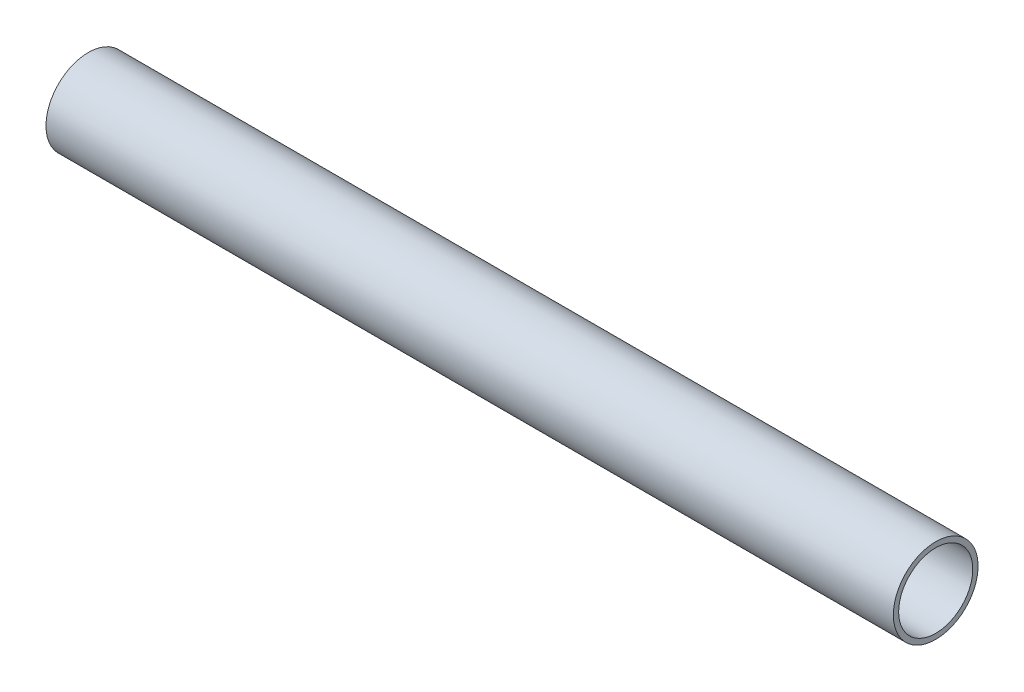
ISO-10303-21;
HEADER;
FILE_DESCRIPTION(('STEP AP214'),'2;1');
FILE_NAME('part.step','',(''),(''),'','','');
FILE_SCHEMA(('AUTOMOTIVE_DESIGN { 1 0 10303 214 1 1 1 1 }'));
ENDSEC;
DATA;
#1=APPLICATION_CONTEXT('core data for automotive mechanical design processes');
#2=APPLICATION_PROTOCOL_DEFINITION('international standard','automotive_design',2000,#1);
#3=PRODUCT_CONTEXT('',#1,'mechanical');
#4=PRODUCT('Part','Part','',(#3));
#5=PRODUCT_RELATED_PRODUCT_CATEGORY('part','',(#4));
#6=PRODUCT_DEFINITION_FORMATION('','',#4);
#7=PRODUCT_DEFINITION_CONTEXT('part definition',#1,'design');
#8=PRODUCT_DEFINITION('design','',#6,#7);
#9=PRODUCT_DEFINITION_SHAPE('','',#8);
#10=(LENGTH_UNIT() NAMED_UNIT(*) SI_UNIT(.MILLI.,.METRE.));
#11=(NAMED_UNIT(*) PLANE_ANGLE_UNIT() SI_UNIT($,.RADIAN.));
#12=(NAMED_UNIT(*) SI_UNIT($,.STERADIAN.) SOLID_ANGLE_UNIT());
#13=UNCERTAINTY_MEASURE_WITH_UNIT(LENGTH_MEASURE(1.E-05),#10,'distance_accuracy_value','');
#14=(GEOMETRIC_REPRESENTATION_CONTEXT(3) GLOBAL_UNCERTAINTY_ASSIGNED_CONTEXT((#13)) GLOBAL_UNIT_ASSIGNED_CONTEXT((#10,
#11,#12)) REPRESENTATION_CONTEXT('',''));
#15=CARTESIAN_POINT('',(0.,0.,0.));
#16=DIRECTION('',(0.,0.,1.));
#17=DIRECTION('',(1.,0.,0.));
#18=AXIS2_PLACEMENT_3D('',#15,#16,#17);
#19=CARTESIAN_POINT('',(0.,8.,0.));
#20=DIRECTION('',(1.,0.,0.));
#21=DIRECTION('',(0.,0.,-1.));
#22=AXIS2_PLACEMENT_3D('',#19,#20,#21);
#23=PLANE('',#22);
#24=CARTESIAN_POINT('',(0.,0.,0.));
#25=DIRECTION('',(-1.,0.,0.));
#26=DIRECTION('',(0.,0.,1.));
#27=AXIS2_PLACEMENT_3D('',#24,#25,#26);
#28=CIRCLE('',#27,7.00000000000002);
#29=CARTESIAN_POINT('',(0.,0.,7.00000000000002));
#30=VERTEX_POINT('',#29);
#31=EDGE_CURVE('E44',#30,#30,#28,.T.);
#32=ORIENTED_EDGE('',*,*,#31,.F.);
#33=EDGE_LOOP('',(#32));
#34=FACE_BOUND('',#33,.T.);
#35=CARTESIAN_POINT('',(0.,0.,0.));
#36=DIRECTION('',(-1.,0.,0.));
#37=DIRECTION('',(0.,0.,1.));
#38=AXIS2_PLACEMENT_3D('',#35,#36,#37);
#39=CIRCLE('',#38,8.);
#40=CARTESIAN_POINT('',(0.,0.,8.));
#41=VERTEX_POINT('',#40);
#42=EDGE_CURVE('E10',#41,#41,#39,.T.);
#43=ORIENTED_EDGE('',*,*,#42,.T.);
#44=EDGE_LOOP('',(#43));
#45=FACE_BOUND('',#44,.T.);
#46=ADVANCED_FACE('F30',(#34,#45),#23,.F.);
#47=CARTESIAN_POINT('',(0.,0.,0.));
#48=DIRECTION('',(-1.,0.,0.));
#49=DIRECTION('',(0.,0.,1.));
#50=AXIS2_PLACEMENT_3D('',#47,#48,#49);
#51=CYLINDRICAL_SURFACE('',#50,8.);
#52=CARTESIAN_POINT('',(160.,0.,0.));
#53=DIRECTION('',(-1.,0.,0.));
#54=DIRECTION('',(0.,0.,1.));
#55=AXIS2_PLACEMENT_3D('',#52,#53,#54);
#56=CIRCLE('',#55,8.);
#57=CARTESIAN_POINT('',(160.,0.,8.));
#58=VERTEX_POINT('',#57);
#59=EDGE_CURVE('E36',#58,#58,#56,.T.);
#60=ORIENTED_EDGE('',*,*,#59,.T.);
#61=EDGE_LOOP('',(#60));
#62=FACE_BOUND('',#61,.T.);
#63=ORIENTED_EDGE('',*,*,#42,.F.);
#64=EDGE_LOOP('',(#63));
#65=FACE_BOUND('',#64,.T.);
#66=ADVANCED_FACE('F54',(#62,#65),#51,.T.);
#67=CARTESIAN_POINT('',(160.,7.00000000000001,0.));
#68=DIRECTION('',(-1.,0.,0.));
#69=DIRECTION('',(0.,0.,1.));
#70=AXIS2_PLACEMENT_3D('',#67,#68,#69);
#71=PLANE('',#70);
#72=ORIENTED_EDGE('',*,*,#59,.F.);
#73=EDGE_LOOP('',(#72));
#74=FACE_BOUND('',#73,.T.);
#75=CARTESIAN_POINT('',(160.,0.,0.));
#76=DIRECTION('',(-1.,0.,0.));
#77=DIRECTION('',(0.,0.,1.));
#78=AXIS2_PLACEMENT_3D('',#75,#76,#77);
#79=CIRCLE('',#78,7.00000000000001);
#80=CARTESIAN_POINT('',(160.,0.,7.00000000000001));
#81=VERTEX_POINT('',#80);
#82=EDGE_CURVE('E40',#81,#81,#79,.T.);
#83=ORIENTED_EDGE('',*,*,#82,.T.);
#84=EDGE_LOOP('',(#83));
#85=FACE_BOUND('',#84,.T.);
#86=ADVANCED_FACE('F58',(#74,#85),#71,.F.);
#87=CARTESIAN_POINT('',(0.,0.,0.));
#88=DIRECTION('',(-1.,0.,0.));
#89=DIRECTION('',(0.,0.,1.));
#90=AXIS2_PLACEMENT_3D('',#87,#88,#89);
#91=CYLINDRICAL_SURFACE('',#90,7.00000000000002);
#92=ORIENTED_EDGE('',*,*,#31,.T.);
#93=EDGE_LOOP('',(#92));
#94=FACE_BOUND('',#93,.T.);
#95=ORIENTED_EDGE('',*,*,#82,.F.);
#96=EDGE_LOOP('',(#95));
#97=FACE_BOUND('',#96,.T.);
#98=ADVANCED_FACE('F50',(#94,#97),#91,.F.);
#99=CLOSED_SHELL('',(#46,#66,#86,#98));
#100=MANIFOLD_SOLID_BREP('B2',#99);
#101=ADVANCED_BREP_SHAPE_REPRESENTATION('',(#18,#100),#14);
#102=SHAPE_DEFINITION_REPRESENTATION(#9,#101);
ENDSEC;
END-ISO-10303-21;
